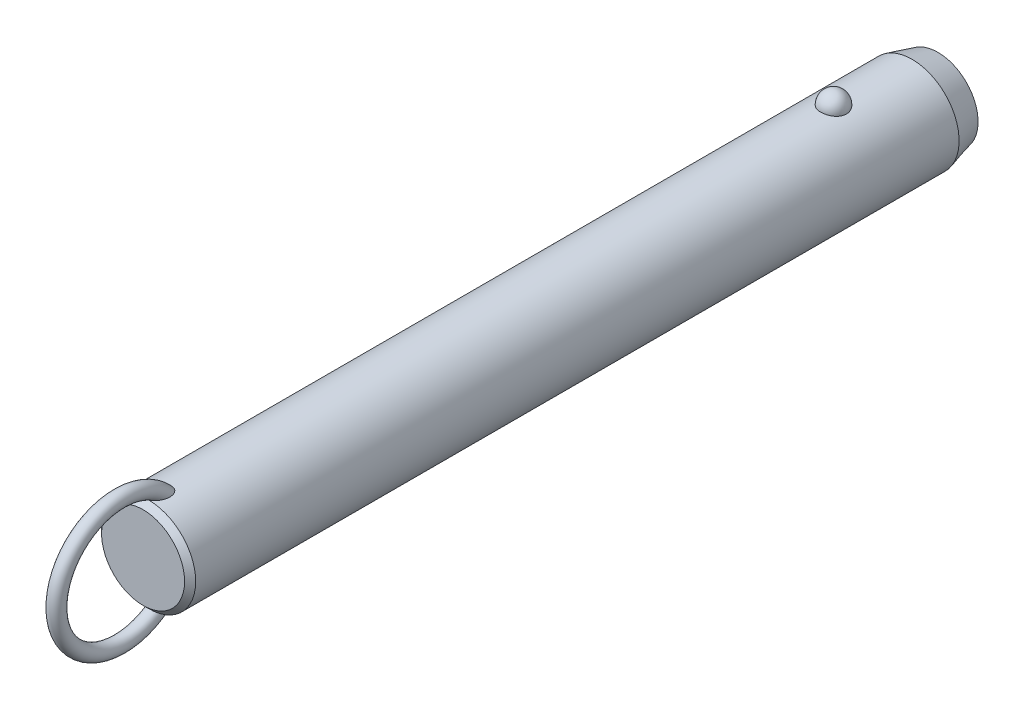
ISO-10303-21;
HEADER;
FILE_DESCRIPTION(('STEP AP214'),'2;1');
FILE_NAME('part.step','',(''),(''),'','','');
FILE_SCHEMA(('AUTOMOTIVE_DESIGN { 1 0 10303 214 1 1 1 1 }'));
ENDSEC;
DATA;
#1=APPLICATION_CONTEXT('core data for automotive mechanical design processes');
#2=APPLICATION_PROTOCOL_DEFINITION('international standard','automotive_design',2000,#1);
#3=PRODUCT_CONTEXT('',#1,'mechanical');
#4=PRODUCT('Part','Part','',(#3));
#5=PRODUCT_RELATED_PRODUCT_CATEGORY('part','',(#4));
#6=PRODUCT_DEFINITION_FORMATION('','',#4);
#7=PRODUCT_DEFINITION_CONTEXT('part definition',#1,'design');
#8=PRODUCT_DEFINITION('design','',#6,#7);
#9=PRODUCT_DEFINITION_SHAPE('','',#8);
#10=(LENGTH_UNIT() NAMED_UNIT(*) SI_UNIT(.MILLI.,.METRE.));
#11=(NAMED_UNIT(*) PLANE_ANGLE_UNIT() SI_UNIT($,.RADIAN.));
#12=(NAMED_UNIT(*) SI_UNIT($,.STERADIAN.) SOLID_ANGLE_UNIT());
#13=UNCERTAINTY_MEASURE_WITH_UNIT(LENGTH_MEASURE(1.E-05),#10,'distance_accuracy_value','');
#14=(GEOMETRIC_REPRESENTATION_CONTEXT(3) GLOBAL_UNCERTAINTY_ASSIGNED_CONTEXT((#13)) GLOBAL_UNIT_ASSIGNED_CONTEXT((#10,
#11,#12)) REPRESENTATION_CONTEXT('',''));
#15=CARTESIAN_POINT('',(0.,0.,0.));
#16=DIRECTION('',(0.,0.,1.));
#17=DIRECTION('',(1.,0.,0.));
#18=AXIS2_PLACEMENT_3D('',#15,#16,#17);
#19=CARTESIAN_POINT('',(0.,0.,170.2));
#20=DIRECTION('',(0.,0.,-1.));
#21=DIRECTION('',(-1.,0.,0.));
#22=AXIS2_PLACEMENT_3D('',#19,#20,#21);
#23=CYLINDRICAL_SURFACE('',#22,12.7);
#24=CARTESIAN_POINT('',(3.46661256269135,12.2177165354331,-3.5));
#25=CARTESIAN_POINT('',(3.4666090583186,12.2177194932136,-3.30432790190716));
#26=CARTESIAN_POINT('',(3.45063567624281,12.2222841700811,-3.10861112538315));
#27=CARTESIAN_POINT('',(3.38712451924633,12.2400345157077,-2.72271899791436));
#28=CARTESIAN_POINT('',(3.33957415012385,12.2532236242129,-2.53254588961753));
#29=CARTESIAN_POINT('',(3.2141234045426,12.286724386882,-2.16324948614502));
#30=CARTESIAN_POINT('',(3.13623639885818,12.3070329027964,-1.98412136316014));
#31=CARTESIAN_POINT('',(2.95205930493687,12.3525018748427,-1.64180592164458));
#32=CARTESIAN_POINT('',(2.84577003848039,12.3776621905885,-1.47861814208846));
#33=CARTESIAN_POINT('',(2.60688050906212,12.4301712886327,-1.17190583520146));
#34=CARTESIAN_POINT('',(2.47415697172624,12.4575299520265,-1.02847897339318));
#35=CARTESIAN_POINT('',(2.18615174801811,12.5112810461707,-0.766177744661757));
#36=CARTESIAN_POINT('',(2.03087002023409,12.5376734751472,-0.647303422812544));
#37=CARTESIAN_POINT('',(1.70237334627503,12.5864761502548,-0.437732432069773));
#38=CARTESIAN_POINT('',(1.52920948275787,12.6088972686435,-0.34695830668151));
#39=CARTESIAN_POINT('',(1.16944170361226,12.6473352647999,-0.195750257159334));
#40=CARTESIAN_POINT('',(0.982839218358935,12.663352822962,-0.135313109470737));
#41=CARTESIAN_POINT('',(0.604961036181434,12.6869706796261,-0.0473241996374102));
#42=CARTESIAN_POINT('',(0.413823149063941,12.6947125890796,-0.0192185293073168));
#43=CARTESIAN_POINT('',(0.0293827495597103,12.7014203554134,0.00517254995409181));
#44=CARTESIAN_POINT('',(-0.163919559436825,12.7003870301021,0.00146092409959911));
#45=CARTESIAN_POINT('',(-0.544374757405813,12.689735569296,-0.0373939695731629));
#46=CARTESIAN_POINT('',(-0.731575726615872,12.6802364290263,-0.0721015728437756));
#47=CARTESIAN_POINT('',(-1.09733277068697,12.6538333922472,-0.171364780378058));
#48=CARTESIAN_POINT('',(-1.27588869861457,12.6369293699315,-0.23592089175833));
#49=CARTESIAN_POINT('',(-1.6204698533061,12.5973946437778,-0.393548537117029));
#50=CARTESIAN_POINT('',(-1.78641865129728,12.5747321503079,-0.48677898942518));
#51=CARTESIAN_POINT('',(-2.10030671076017,12.5261316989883,-0.699110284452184));
#52=CARTESIAN_POINT('',(-2.24824419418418,12.5001934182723,-0.818213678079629));
#53=CARTESIAN_POINT('',(-2.52491489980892,12.4472906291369,-1.08157124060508));
#54=CARTESIAN_POINT('',(-2.65324222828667,12.4203160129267,-1.22624992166));
#55=CARTESIAN_POINT('',(-2.88410007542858,12.3687509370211,-1.53528325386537));
#56=CARTESIAN_POINT('',(-2.98662883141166,12.3441606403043,-1.69963924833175));
#57=CARTESIAN_POINT('',(-3.16432417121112,12.2998199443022,-2.04548497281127));
#58=CARTESIAN_POINT('',(-3.23917525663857,12.2801261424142,-2.22714424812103));
#59=CARTESIAN_POINT('',(-3.35800573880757,12.248167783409,-2.6009138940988));
#60=CARTESIAN_POINT('',(-3.4019860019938,12.2359030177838,-2.79302397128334));
#61=CARTESIAN_POINT('',(-3.45784812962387,12.2202347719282,-3.18140279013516));
#62=CARTESIAN_POINT('',(-3.46986123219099,12.2167950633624,-3.37765118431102));
#63=CARTESIAN_POINT('',(-3.46186273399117,12.2190638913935,-3.76943689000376));
#64=CARTESIAN_POINT('',(-3.44185196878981,12.2247721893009,-3.96497421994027));
#65=CARTESIAN_POINT('',(-3.37048652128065,12.2446381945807,-4.34881728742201));
#66=CARTESIAN_POINT('',(-3.31928253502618,12.2587552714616,-4.53715319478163));
#67=CARTESIAN_POINT('',(-3.18693461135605,12.2938237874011,-4.90231727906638));
#68=CARTESIAN_POINT('',(-3.1057895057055,12.3147754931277,-5.07914500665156));
#69=CARTESIAN_POINT('',(-2.91506431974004,12.3613125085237,-5.4173205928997));
#70=CARTESIAN_POINT('',(-2.80533587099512,12.3869217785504,-5.57858147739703));
#71=CARTESIAN_POINT('',(-2.560414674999,12.4398525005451,-5.88013283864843));
#72=CARTESIAN_POINT('',(-2.42522099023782,12.4671740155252,-6.02042254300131));
#73=CARTESIAN_POINT('',(-2.1323357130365,12.5205965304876,-6.27662798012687));
#74=CARTESIAN_POINT('',(-1.97456596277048,12.5466928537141,-6.39245542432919));
#75=CARTESIAN_POINT('',(-1.64115839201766,12.5946384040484,-6.59583547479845));
#76=CARTESIAN_POINT('',(-1.46552179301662,12.6164879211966,-6.68339001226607));
#77=CARTESIAN_POINT('',(-1.10356050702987,12.6532533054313,-6.82682153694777));
#78=CARTESIAN_POINT('',(-0.917391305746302,12.6682500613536,-6.88306988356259));
#79=CARTESIAN_POINT('',(-0.537836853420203,12.6900288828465,-6.96386887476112));
#80=CARTESIAN_POINT('',(-0.344452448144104,12.6968119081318,-6.9884232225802));
#81=CARTESIAN_POINT('',(0.0402577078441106,12.7013667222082,-7.00496469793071));
#82=CARTESIAN_POINT('',(0.231556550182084,12.6993008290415,-6.99753844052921));
#83=CARTESIAN_POINT('',(0.610105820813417,12.6867505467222,-6.95166366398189));
#84=CARTESIAN_POINT('',(0.797356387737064,12.6762664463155,-6.91321620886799));
#85=CARTESIAN_POINT('',(1.16186657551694,12.6480587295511,-6.80658431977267));
#86=CARTESIAN_POINT('',(1.33915951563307,12.6303611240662,-6.73850666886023));
#87=CARTESIAN_POINT('',(1.67968518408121,12.5896027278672,-6.57450875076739));
#88=CARTESIAN_POINT('',(1.84291705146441,12.5665416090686,-6.47858678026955));
#89=CARTESIAN_POINT('',(2.15340192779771,12.5171072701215,-6.25982455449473));
#90=CARTESIAN_POINT('',(2.30037831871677,12.4906895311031,-6.13660186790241));
#91=CARTESIAN_POINT('',(2.5717412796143,12.4376567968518,-5.86739587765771));
#92=CARTESIAN_POINT('',(2.69612388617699,12.4110417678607,-5.72140858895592));
#93=CARTESIAN_POINT('',(2.92107785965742,12.360051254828,-5.40794137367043));
#94=CARTESIAN_POINT('',(3.02121329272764,12.3357209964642,-5.24014110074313));
#95=CARTESIAN_POINT('',(3.19236291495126,12.2925446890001,-4.8896986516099));
#96=CARTESIAN_POINT('',(3.26338839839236,12.2736965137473,-4.70706226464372));
#97=CARTESIAN_POINT('',(3.36788038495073,12.245404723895,-4.35469510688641));
#98=CARTESIAN_POINT('',(3.40484026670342,12.2351018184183,-4.18605935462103));
#99=CARTESIAN_POINT('',(3.45420764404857,12.2212564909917,-3.84496058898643));
#100=CARTESIAN_POINT('',(3.46661565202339,12.2177139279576,-3.67249765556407));
#101=CARTESIAN_POINT('',(3.46661256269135,12.2177165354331,-3.5));
#102=B_SPLINE_CURVE_WITH_KNOTS('',3,(#24,#25,#26,#27,#28,#29,#30,#31,#32,#33,#34,#35,#36,#37,
#38,#39,#40,#41,#42,#43,#44,#45,#46,#47,#48,#49,#50,#51,#52,#53,#54,#55,#56,#57,#58,#59,#60,#61,
#62,#63,#64,#65,#66,#67,#68,#69,#70,#71,#72,#73,#74,#75,#76,#77,#78,#79,#80,#81,#82,#83,#84,#85,
#86,#87,#88,#89,#90,#91,#92,#93,#94,#95,#96,#97,#98,#99,#100,#101),.UNSPECIFIED.,.T.,.F.,(4,2,2,
2,2,2,2,2,2,2,2,2,2,2,2,2,2,2,2,2,2,2,2,2,2,2,2,2,2,2,2,2,2,2,2,2,2,2,4),(0.,0.586396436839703,
1.17302689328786,1.7593990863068,2.34575431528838,2.93491084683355,3.52406845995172,
4.1115873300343,4.69904375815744,5.2762784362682,5.85345931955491,6.42265312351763,
6.99185659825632,7.56427334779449,8.136746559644,8.71981013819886,9.3029135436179,
9.89247258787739,10.4820150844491,11.0691335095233,11.6562366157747,12.2405256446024,
12.8248374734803,13.412244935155,13.9996740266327,14.5891883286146,15.1786623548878,
15.7609861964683,16.3432419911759,16.914863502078,17.4864654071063,18.056024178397,
18.6256177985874,19.2037609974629,19.7820055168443,20.3699810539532,20.9577282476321,
21.4746855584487,21.9916320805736),.UNSPECIFIED.);
#103=CARTESIAN_POINT('',(3.46661256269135,12.2177165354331,-3.5));
#104=VERTEX_POINT('',#103);
#105=EDGE_CURVE('E41',#104,#104,#102,.T.);
#106=ORIENTED_EDGE('',*,*,#105,.T.);
#107=EDGE_LOOP('',(#106));
#108=FACE_BOUND('',#107,.T.);
#109=CARTESIAN_POINT('',(0.,0.,181.4));
#110=DIRECTION('',(0.,0.,1.));
#111=DIRECTION('',(1.,0.,0.));
#112=AXIS2_PLACEMENT_3D('',#109,#110,#111);
#113=CIRCLE('',#112,12.7);
#114=CARTESIAN_POINT('',(12.7,0.,181.4));
#115=VERTEX_POINT('',#114);
#116=EDGE_CURVE('E10',#115,#115,#113,.F.);
#117=ORIENTED_EDGE('',*,*,#116,.T.);
#118=EDGE_LOOP('',(#117));
#119=FACE_BOUND('',#118,.T.);
#120=CARTESIAN_POINT('',(-0.548122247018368,-12.6881662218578,175.143218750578));
#121=CARTESIAN_POINT('',(-0.648865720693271,-12.6838128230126,175.177926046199));
#122=CARTESIAN_POINT('',(-0.746398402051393,-12.6783867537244,175.222042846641));
#123=CARTESIAN_POINT('',(-0.932125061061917,-12.666091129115,175.326764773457));
#124=CARTESIAN_POINT('',(-1.02030388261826,-12.6592192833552,175.387396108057));
#125=CARTESIAN_POINT('',(-1.18487740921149,-12.6448747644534,175.521847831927));
#126=CARTESIAN_POINT('',(-1.26134296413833,-12.637406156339,175.595582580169));
#127=CARTESIAN_POINT('',(-1.40231200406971,-12.6225412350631,175.753604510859));
#128=CARTESIAN_POINT('',(-1.46681470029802,-12.6151449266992,175.83789238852));
#129=CARTESIAN_POINT('',(-1.60714786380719,-12.5981718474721,176.049657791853));
#130=CARTESIAN_POINT('',(-1.677251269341,-12.588900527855,176.180962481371));
#131=CARTESIAN_POINT('',(-1.79536591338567,-12.5725964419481,176.453247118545));
#132=CARTESIAN_POINT('',(-1.84333535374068,-12.5655679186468,176.594244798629));
#133=CARTESIAN_POINT('',(-1.93422576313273,-12.5519624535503,176.937645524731));
#134=CARTESIAN_POINT('',(-1.96788773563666,-12.5466298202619,177.142557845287));
#135=CARTESIAN_POINT('',(-1.99413993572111,-12.542463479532,177.451760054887));
#136=CARTESIAN_POINT('',(-1.99883864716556,-12.5417153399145,177.555298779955));
#137=CARTESIAN_POINT('',(-2.00078003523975,-12.5414074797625,177.76245124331));
#138=CARTESIAN_POINT('',(-1.99802449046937,-12.5418474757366,177.866064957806));
#139=CARTESIAN_POINT('',(-1.98336733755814,-12.5441750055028,178.110320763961));
#140=CARTESIAN_POINT('',(-1.96851430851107,-12.5465291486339,178.250780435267));
#141=CARTESIAN_POINT('',(-1.92707089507,-12.5529612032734,178.529960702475));
#142=CARTESIAN_POINT('',(-1.90047458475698,-12.5570399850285,178.668680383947));
#143=CARTESIAN_POINT('',(-1.8361912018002,-12.5666008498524,178.94341135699));
#144=CARTESIAN_POINT('',(-1.79850828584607,-12.57208240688,179.079423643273));
#145=CARTESIAN_POINT('',(-1.71223796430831,-12.5841228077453,179.347842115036));
#146=CARTESIAN_POINT('',(-1.66365679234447,-12.5906810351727,179.480250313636));
#147=CARTESIAN_POINT('',(-1.57804503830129,-12.6016176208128,179.68548877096));
#148=CARTESIAN_POINT('',(-1.54477252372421,-12.6057501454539,179.759914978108));
#149=CARTESIAN_POINT('',(-1.47424480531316,-12.6141930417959,179.906839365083));
#150=CARTESIAN_POINT('',(-1.43699041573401,-12.6185033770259,179.979337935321));
#151=CARTESIAN_POINT('',(-1.35825795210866,-12.6272207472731,180.121892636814));
#152=CARTESIAN_POINT('',(-1.31678520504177,-12.6316276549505,180.191951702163));
#153=CARTESIAN_POINT('',(-1.22917793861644,-12.6404532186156,180.329070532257));
#154=CARTESIAN_POINT('',(-1.18304514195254,-12.6448718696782,180.396131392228));
#155=CARTESIAN_POINT('',(-1.07246411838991,-12.6547893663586,180.543874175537));
#156=CARTESIAN_POINT('',(-1.00642239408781,-12.6602600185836,180.623384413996));
#157=CARTESIAN_POINT('',(-0.864441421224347,-12.6707460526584,180.773169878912));
#158=CARTESIAN_POINT('',(-0.788516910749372,-12.6757620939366,180.843458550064));
#159=CARTESIAN_POINT('',(-0.652215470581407,-12.6833591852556,180.948680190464));
#160=CARTESIAN_POINT('',(-0.594982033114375,-12.6861973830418,180.987624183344));
#161=CARTESIAN_POINT('',(-0.47526962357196,-12.6912445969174,181.056489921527));
#162=CARTESIAN_POINT('',(-0.412800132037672,-12.6934547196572,181.086427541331));
#163=CARTESIAN_POINT('',(-0.29574972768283,-12.6966636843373,181.12975652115));
#164=CARTESIAN_POINT('',(-0.241949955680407,-12.6978134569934,181.145218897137));
#165=CARTESIAN_POINT('',(-0.132508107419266,-12.6994261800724,181.166884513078));
#166=CARTESIAN_POINT('',(-0.0768679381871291,-12.6998898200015,181.173097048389));
#167=CARTESIAN_POINT('',(0.0347696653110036,-12.7000752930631,181.175583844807));
#168=CARTESIAN_POINT('',(0.0907676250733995,-12.6997954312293,181.171835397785));
#169=CARTESIAN_POINT('',(0.201283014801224,-12.6985255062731,181.154788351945));
#170=CARTESIAN_POINT('',(0.25579908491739,-12.6975348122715,181.141481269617));
#171=CARTESIAN_POINT('',(0.37604233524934,-12.6946091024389,181.10203792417));
#172=CARTESIAN_POINT('',(0.440950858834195,-12.6924943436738,181.073449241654));
#173=CARTESIAN_POINT('',(0.565350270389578,-12.6875639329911,181.006323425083));
#174=CARTESIAN_POINT('',(0.624828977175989,-12.6847467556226,180.967764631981));
#175=CARTESIAN_POINT('',(0.774116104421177,-12.6767252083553,180.856949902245));
#176=CARTESIAN_POINT('',(0.859449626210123,-12.6711344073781,180.778760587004));
#177=CARTESIAN_POINT('',(1.01789440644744,-12.6593922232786,180.610943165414));
#178=CARTESIAN_POINT('',(1.09096902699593,-12.653239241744,180.521282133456));
#179=CARTESIAN_POINT('',(1.22268793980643,-12.6411674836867,180.340265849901));
#180=CARTESIAN_POINT('',(1.28193986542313,-12.6352572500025,180.249345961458));
#181=CARTESIAN_POINT('',(1.39259777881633,-12.6235401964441,180.062792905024));
#182=CARTESIAN_POINT('',(1.44399707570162,-12.6177334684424,179.967155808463));
#183=CARTESIAN_POINT('',(1.53972870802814,-12.6064093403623,179.772273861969));
#184=CARTESIAN_POINT('',(1.58405262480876,-12.6008922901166,179.673024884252));
#185=CARTESIAN_POINT('',(1.66600705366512,-12.5903187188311,179.471772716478));
#186=CARTESIAN_POINT('',(1.7036365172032,-12.5852622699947,179.369769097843));
#187=CARTESIAN_POINT('',(1.77545379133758,-12.5753406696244,179.154358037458));
#188=CARTESIAN_POINT('',(1.80903453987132,-12.5705328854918,179.040745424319));
#189=CARTESIAN_POINT('',(1.86844163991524,-12.5618400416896,178.811457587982));
#190=CARTESIAN_POINT('',(1.89426665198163,-12.5579551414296,178.695782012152));
#191=CARTESIAN_POINT('',(1.9378546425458,-12.5513030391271,178.463007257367));
#192=CARTESIAN_POINT('',(1.9556264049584,-12.5485346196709,178.345909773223));
#193=CARTESIAN_POINT('',(1.98264463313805,-12.5442934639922,178.110747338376));
#194=CARTESIAN_POINT('',(1.99189298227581,-12.5428204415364,177.99268260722));
#195=CARTESIAN_POINT('',(2.00416068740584,-12.540871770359,177.680622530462));
#196=CARTESIAN_POINT('',(1.99944433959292,-12.541631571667,177.486229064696));
#197=CARTESIAN_POINT('',(1.96113755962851,-12.5476846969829,177.100309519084));
#198=CARTESIAN_POINT('',(1.92758341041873,-12.5529723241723,176.908780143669));
#199=CARTESIAN_POINT('',(1.83934342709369,-12.5661532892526,176.582272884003));
#200=CARTESIAN_POINT('',(1.79215440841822,-12.5730485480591,176.44524997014));
#201=CARTESIAN_POINT('',(1.67676242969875,-12.588958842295,176.180445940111));
#202=CARTESIAN_POINT('',(1.60859050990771,-12.597970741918,176.052651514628));
#203=CARTESIAN_POINT('',(1.46583832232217,-12.6152829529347,175.835800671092));
#204=CARTESIAN_POINT('',(1.39525727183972,-12.6233659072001,175.74410500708));
#205=CARTESIAN_POINT('',(1.23992594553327,-12.6395676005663,175.573485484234));
#206=CARTESIAN_POINT('',(1.15517932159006,-12.6476863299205,175.494558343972));
#207=CARTESIAN_POINT('',(0.971995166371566,-12.6630846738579,175.352643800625));
#208=CARTESIAN_POINT('',(0.873456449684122,-12.6703572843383,175.289784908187));
#209=CARTESIAN_POINT('',(0.665847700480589,-12.6829569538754,175.184487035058));
#210=CARTESIAN_POINT('',(0.556784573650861,-12.688285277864,175.142034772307));
#211=CARTESIAN_POINT('',(0.347338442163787,-12.6956226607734,175.084443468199));
#212=CARTESIAN_POINT('',(0.247759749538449,-12.6979816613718,175.066399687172));
#213=CARTESIAN_POINT('',(0.0470218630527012,-12.7003077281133,175.048600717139));
#214=CARTESIAN_POINT('',(-0.0541350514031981,-12.7002779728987,175.048821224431));
#215=CARTESIAN_POINT('',(-0.221414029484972,-12.6982482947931,175.064363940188));
#216=CARTESIAN_POINT('',(-0.288055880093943,-12.6969033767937,175.074666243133));
#217=CARTESIAN_POINT('',(-0.419599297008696,-12.6932369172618,175.10313489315));
#218=CARTESIAN_POINT('',(-0.484501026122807,-12.6909154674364,175.121300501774));
#219=CARTESIAN_POINT('',(-0.548122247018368,-12.6881662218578,175.143218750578));
#220=B_SPLINE_CURVE_WITH_KNOTS('',3,(#120,#121,#122,#123,#124,#125,#126,#127,#128,#129,#130,
#131,#132,#133,#134,#135,#136,#137,#138,#139,#140,#141,#142,#143,#144,#145,#146,#147,#148,#149,
#150,#151,#152,#153,#154,#155,#156,#157,#158,#159,#160,#161,#162,#163,#164,#165,#166,#167,#168,
#169,#170,#171,#172,#173,#174,#175,#176,#177,#178,#179,#180,#181,#182,#183,#184,#185,#186,#187,
#188,#189,#190,#191,#192,#193,#194,#195,#196,#197,#198,#199,#200,#201,#202,#203,#204,#205,#206,
#207,#208,#209,#210,#211,#212,#213,#214,#215,#216,#217,#218,#219),.UNSPECIFIED.,.T.,.F.,(4,2,2,
2,2,2,2,2,2,2,2,2,2,2,2,2,2,2,2,2,2,2,2,2,2,2,2,2,2,2,2,2,2,2,2,2,2,2,2,2,2,2,2,2,2,2,2,2,2,4),
(0.,0.319642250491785,0.639794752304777,0.957927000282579,1.27608021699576,1.72100165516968,
2.16675988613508,2.78630021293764,3.09705782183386,3.4077412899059,3.83096358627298,
4.25439969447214,4.6776772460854,5.10071330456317,5.3455029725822,5.59024267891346,
5.83467707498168,6.07902143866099,6.38891080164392,6.69834321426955,6.90560910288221,
7.11250749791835,7.27977315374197,7.44687060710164,7.61434932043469,7.78197685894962,
7.99365544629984,8.20579780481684,8.55147335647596,8.89816429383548,9.22375138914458,
9.54961437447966,9.87586224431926,10.2021611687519,10.557587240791,10.9130746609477,
11.2681734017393,11.6231936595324,12.2046601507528,12.7853961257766,13.219164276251,
13.6522938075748,13.9989174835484,14.3454519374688,14.6946768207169,15.0436740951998,
15.3457513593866,15.6474266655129,15.8493051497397,16.0511646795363),.UNSPECIFIED.);
#221=CARTESIAN_POINT('',(-0.548122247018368,-12.6881662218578,175.143218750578));
#222=VERTEX_POINT('',#221);
#223=EDGE_CURVE('E60',#222,#222,#220,.T.);
#224=ORIENTED_EDGE('',*,*,#223,.T.);
#225=EDGE_LOOP('',(#224));
#226=FACE_BOUND('',#225,.T.);
#227=CARTESIAN_POINT('',(-0.548122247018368,12.6881662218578,175.143218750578));
#228=CARTESIAN_POINT('',(-0.459436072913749,12.6919968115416,175.112673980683));
#229=CARTESIAN_POINT('',(-0.368189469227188,12.6949996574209,175.089391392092));
#230=CARTESIAN_POINT('',(-0.183024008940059,12.6990186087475,175.058406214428));
#231=CARTESIAN_POINT('',(-0.08910491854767,12.7000345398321,175.050704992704));
#232=CARTESIAN_POINT('',(0.098714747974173,12.6999636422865,175.051245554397));
#233=CARTESIAN_POINT('',(0.192615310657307,12.6988761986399,175.059492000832));
#234=CARTESIAN_POINT('',(0.377658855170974,12.6947211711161,175.091551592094));
#235=CARTESIAN_POINT('',(0.468801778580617,12.6916535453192,175.115365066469));
#236=CARTESIAN_POINT('',(0.645809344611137,12.6838788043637,175.17745651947));
#237=CARTESIAN_POINT('',(0.731679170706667,12.6791733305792,175.215720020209));
#238=CARTESIAN_POINT('',(0.896315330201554,12.6686004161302,175.305120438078));
#239=CARTESIAN_POINT('',(0.975080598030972,12.6627328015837,175.356259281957));
#240=CARTESIAN_POINT('',(1.12963655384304,12.6499161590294,175.47367820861));
#241=CARTESIAN_POINT('',(1.20478673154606,12.6429194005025,175.540792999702));
#242=CARTESIAN_POINT('',(1.34448241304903,12.6288282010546,175.68522507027));
#243=CARTESIAN_POINT('',(1.40902173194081,12.621733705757,175.762548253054));
#244=CARTESIAN_POINT('',(1.55208211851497,12.6050877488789,175.959247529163));
#245=CARTESIAN_POINT('',(1.62510490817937,12.5957546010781,176.082654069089));
#246=CARTESIAN_POINT('',(1.7501904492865,12.5789823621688,176.339769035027));
#247=CARTESIAN_POINT('',(1.80221377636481,12.5715468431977,176.473496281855));
#248=CARTESIAN_POINT('',(1.90309965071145,12.5567434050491,176.798351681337));
#249=CARTESIAN_POINT('',(1.94342317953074,12.5504515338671,176.992161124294));
#250=CARTESIAN_POINT('',(1.99332997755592,12.5426147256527,177.38378810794));
#251=CARTESIAN_POINT('',(2.00285305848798,12.5410790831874,177.581612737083));
#252=CARTESIAN_POINT('',(1.99678999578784,12.5420407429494,177.916642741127));
#253=CARTESIAN_POINT('',(1.98794117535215,12.5434564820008,178.054042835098));
#254=CARTESIAN_POINT('',(1.95865119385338,12.5480641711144,178.327639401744));
#255=CARTESIAN_POINT('',(1.93820436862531,12.5512569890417,178.463835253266));
#256=CARTESIAN_POINT('',(1.886478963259,12.5591352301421,178.734249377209));
#257=CARTESIAN_POINT('',(1.85518800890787,12.5638223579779,178.868465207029));
#258=CARTESIAN_POINT('',(1.782178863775,12.5743868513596,179.133936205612));
#259=CARTESIAN_POINT('',(1.74046509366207,12.5802637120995,179.265192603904));
#260=CARTESIAN_POINT('',(1.66024095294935,12.5910571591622,179.486085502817));
#261=CARTESIAN_POINT('',(1.62434772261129,12.5957535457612,179.576690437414));
#262=CARTESIAN_POINT('',(1.54709009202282,12.6054762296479,179.755512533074));
#263=CARTESIAN_POINT('',(1.50572681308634,12.6105024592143,179.843730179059));
#264=CARTESIAN_POINT('',(1.41728020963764,12.620748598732,180.016932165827));
#265=CARTESIAN_POINT('',(1.37021377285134,12.625967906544,180.101925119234));
#266=CARTESIAN_POINT('',(1.26969620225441,12.6364721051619,180.268007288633));
#267=CARTESIAN_POINT('',(1.21624929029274,12.6417569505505,180.349099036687));
#268=CARTESIAN_POINT('',(1.10304413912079,12.6521331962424,180.504702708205));
#269=CARTESIAN_POINT('',(1.04340936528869,12.657226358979,180.579303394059));
#270=CARTESIAN_POINT('',(0.915919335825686,12.6670906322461,180.721324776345));
#271=CARTESIAN_POINT('',(0.848064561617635,12.6718617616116,180.78874589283));
#272=CARTESIAN_POINT('',(0.717035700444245,12.67987711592,180.900624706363));
#273=CARTESIAN_POINT('',(0.655526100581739,12.6832377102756,180.946997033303));
#274=CARTESIAN_POINT('',(0.525985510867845,12.6892676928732,181.029619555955));
#275=CARTESIAN_POINT('',(0.457969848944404,12.6919386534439,181.065892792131));
#276=CARTESIAN_POINT('',(0.334859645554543,12.695691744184,181.116657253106));
#277=CARTESIAN_POINT('',(0.281116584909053,12.6970073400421,181.134373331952));
#278=CARTESIAN_POINT('',(0.171425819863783,12.6989609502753,181.160642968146));
#279=CARTESIAN_POINT('',(0.115480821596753,12.699599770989,181.169207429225));
#280=CARTESIAN_POINT('',(0.00272618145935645,12.7001251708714,181.176253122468));
#281=CARTESIAN_POINT('',(-0.0540859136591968,12.7000089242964,181.174696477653));
#282=CARTESIAN_POINT('',(-0.166544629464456,12.6990328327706,181.161600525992));
#283=CARTESIAN_POINT('',(-0.222190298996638,12.6981724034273,181.150053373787));
#284=CARTESIAN_POINT('',(-0.342018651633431,12.695562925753,181.114912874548));
#285=CARTESIAN_POINT('',(-0.405606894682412,12.6936676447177,181.08933225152));
#286=CARTESIAN_POINT('',(-0.52781549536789,12.6891754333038,181.028311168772));
#287=CARTESIAN_POINT('',(-0.586425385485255,12.6865770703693,180.992850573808));
#288=CARTESIAN_POINT('',(-0.731842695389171,12.6792129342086,180.891496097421));
#289=CARTESIAN_POINT('',(-0.814709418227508,12.6740767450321,180.8200395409));
#290=CARTESIAN_POINT('',(-0.969101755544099,12.6632083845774,180.66589007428));
#291=CARTESIAN_POINT('',(-1.04059564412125,12.6574746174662,180.583166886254));
#292=CARTESIAN_POINT('',(-1.16981116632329,12.6461638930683,180.415809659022));
#293=CARTESIAN_POINT('',(-1.22811369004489,12.6405994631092,180.331616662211));
#294=CARTESIAN_POINT('',(-1.33743405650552,12.6295007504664,180.158579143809));
#295=CARTESIAN_POINT('',(-1.38844577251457,12.6239664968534,180.069730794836));
#296=CARTESIAN_POINT('',(-1.48400702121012,12.6130898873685,179.888389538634));
#297=CARTESIAN_POINT('',(-1.52854232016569,12.6077479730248,179.795889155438));
#298=CARTESIAN_POINT('',(-1.61150113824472,12.5974127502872,179.608160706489));
#299=CARTESIAN_POINT('',(-1.64992317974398,12.5924195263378,179.512931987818));
#300=CARTESIAN_POINT('',(-1.73468589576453,12.581070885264,179.28289362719));
#301=CARTESIAN_POINT('',(-1.77831261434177,12.5749388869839,179.147066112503));
#302=CARTESIAN_POINT('',(-1.85439734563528,12.5639437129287,178.872212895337));
#303=CARTESIAN_POINT('',(-1.88684994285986,12.5590811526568,178.733185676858));
#304=CARTESIAN_POINT('',(-1.9400848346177,12.550968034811,178.45309235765));
#305=CARTESIAN_POINT('',(-1.96088706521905,12.5477147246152,178.312030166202));
#306=CARTESIAN_POINT('',(-1.99000539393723,12.5431291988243,178.028668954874));
#307=CARTESIAN_POINT('',(-1.99832911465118,12.5417958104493,177.886370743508));
#308=CARTESIAN_POINT('',(-2.00166624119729,12.5412674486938,177.557627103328));
#309=CARTESIAN_POINT('',(-1.99178843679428,12.5428579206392,177.371088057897));
#310=CARTESIAN_POINT('',(-1.9445518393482,12.5502731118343,177.00162404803));
#311=CARTESIAN_POINT('',(-1.90724032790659,12.5560905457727,176.818693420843));
#312=CARTESIAN_POINT('',(-1.81330718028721,12.5699462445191,176.504848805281));
#313=CARTESIAN_POINT('',(-1.76338820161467,12.5771273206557,176.371910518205));
#314=CARTESIAN_POINT('',(-1.64305018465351,12.593414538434,176.115681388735));
#315=CARTESIAN_POINT('',(-1.57265346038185,12.6025185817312,175.992380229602));
#316=CARTESIAN_POINT('',(-1.42634956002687,12.6198178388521,175.783564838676));
#317=CARTESIAN_POINT('',(-1.35423772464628,12.6278405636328,175.695384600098));
#318=CARTESIAN_POINT('',(-1.19645664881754,12.6437632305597,175.532107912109));
#319=CARTESIAN_POINT('',(-1.11080536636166,12.6516633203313,175.456994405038));
#320=CARTESIAN_POINT('',(-0.947219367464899,12.6648319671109,175.337811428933));
#321=CARTESIAN_POINT('',(-0.871624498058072,12.670300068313,175.290541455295));
#322=CARTESIAN_POINT('',(-0.714161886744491,12.6801492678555,175.2077413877));
#323=CARTESIAN_POINT('',(-0.632295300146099,12.684530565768,175.17220913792));
#324=CARTESIAN_POINT('',(-0.548122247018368,12.6881662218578,175.143218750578));
#325=B_SPLINE_CURVE_WITH_KNOTS('',3,(#227,#228,#229,#230,#231,#232,#233,#234,#235,#236,#237,
#238,#239,#240,#241,#242,#243,#244,#245,#246,#247,#248,#249,#250,#251,#252,#253,#254,#255,#256,
#257,#258,#259,#260,#261,#262,#263,#264,#265,#266,#267,#268,#269,#270,#271,#272,#273,#274,#275,
#276,#277,#278,#279,#280,#281,#282,#283,#284,#285,#286,#287,#288,#289,#290,#291,#292,#293,#294,
#295,#296,#297,#298,#299,#300,#301,#302,#303,#304,#305,#306,#307,#308,#309,#310,#311,#312,#313,
#314,#315,#316,#317,#318,#319,#320,#321,#322,#323,#324),.UNSPECIFIED.,.T.,.F.,(4,2,2,2,2,2,2,2,
2,2,2,2,2,2,2,2,2,2,2,2,2,2,2,2,2,2,2,2,2,2,2,2,2,2,2,2,2,2,2,2,2,2,2,2,2,2,2,2,4),(0.,
0.281328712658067,0.562682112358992,0.844117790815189,1.12555942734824,1.40671982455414,
1.68792232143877,1.98972294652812,2.29169886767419,2.72039860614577,3.14989948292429,
3.74084916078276,4.33295293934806,4.74554109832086,5.15833092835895,5.57159335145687,
5.98468079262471,6.27722775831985,6.56971484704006,6.86135609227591,7.15280542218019,
7.43927407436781,7.72572595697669,7.95635862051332,8.18646071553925,8.35559393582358,
8.52452541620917,8.69408946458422,8.86378678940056,9.06834348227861,9.27332014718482,
9.60010414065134,9.92778432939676,10.2350252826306,10.5425229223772,10.8506864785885,
11.1589244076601,11.5867893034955,12.0148612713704,12.4421984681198,12.8692745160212,
13.4279365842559,13.9856380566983,14.4107062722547,14.8353130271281,15.1765567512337,
15.5173516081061,15.7844129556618,16.051425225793),.UNSPECIFIED.);
#326=CARTESIAN_POINT('',(-0.548122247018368,12.6881662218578,175.143218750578));
#327=VERTEX_POINT('',#326);
#328=EDGE_CURVE('E67',#327,#327,#325,.T.);
#329=ORIENTED_EDGE('',*,*,#328,.T.);
#330=EDGE_LOOP('',(#329));
#331=FACE_BOUND('',#330,.T.);
#332=CARTESIAN_POINT('',(0.,0.,-24.6999999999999));
#333=DIRECTION('',(0.,0.,-1.));
#334=DIRECTION('',(-1.,0.,0.));
#335=AXIS2_PLACEMENT_3D('',#332,#333,#334);
#336=CIRCLE('',#335,12.7);
#337=CARTESIAN_POINT('',(-12.7,0.,-24.6999999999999));
#338=VERTEX_POINT('',#337);
#339=EDGE_CURVE('E57',#338,#338,#336,.F.);
#340=ORIENTED_EDGE('',*,*,#339,.T.);
#341=EDGE_LOOP('',(#340));
#342=FACE_BOUND('',#341,.T.);
#343=ADVANCED_FACE('F37',(#108,#119,#226,#331,#342),#23,.T.);
#344=CARTESIAN_POINT('',(0.,0.,-31.7));
#345=DIRECTION('',(0.,0.,-1.));
#346=DIRECTION('',(-1.,0.,0.));
#347=AXIS2_PLACEMENT_3D('',#344,#345,#346);
#348=PLANE('',#347);
#349=CARTESIAN_POINT('',(0.,0.,-31.7));
#350=DIRECTION('',(0.,0.,-1.));
#351=DIRECTION('',(-1.,0.,0.));
#352=AXIS2_PLACEMENT_3D('',#349,#350,#351);
#353=CIRCLE('',#352,10.8243556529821);
#354=CARTESIAN_POINT('',(-10.8243556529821,0.,-31.7));
#355=VERTEX_POINT('',#354);
#356=EDGE_CURVE('E66',#355,#355,#353,.T.);
#357=ORIENTED_EDGE('',*,*,#356,.T.);
#358=EDGE_LOOP('',(#357));
#359=FACE_BOUND('',#358,.T.);
#360=ADVANCED_FACE('F85',(#359),#348,.T.);
#361=CARTESIAN_POINT('',(0.,0.,-31.7));
#362=DIRECTION('',(0.,0.,1.));
#363=DIRECTION('',(1.,0.,0.));
#364=AXIS2_PLACEMENT_3D('',#361,#362,#363);
#365=CONICAL_SURFACE('',#364,10.8243556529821,0.261799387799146);
#366=ORIENTED_EDGE('',*,*,#339,.F.);
#367=EDGE_LOOP('',(#366));
#368=FACE_BOUND('',#367,.T.);
#369=ORIENTED_EDGE('',*,*,#356,.F.);
#370=EDGE_LOOP('',(#369));
#371=FACE_BOUND('',#370,.T.);
#372=ADVANCED_FACE('F83',(#368,#371),#365,.T.);
#373=CARTESIAN_POINT('',(0.,0.,182.9));
#374=DIRECTION('',(0.,0.,1.));
#375=DIRECTION('',(1.,0.,0.));
#376=AXIS2_PLACEMENT_3D('',#373,#374,#375);
#377=PLANE('',#376);
#378=CARTESIAN_POINT('',(0.,0.,182.9));
#379=DIRECTION('',(0.,0.,1.));
#380=DIRECTION('',(1.,0.,0.));
#381=AXIS2_PLACEMENT_3D('',#378,#379,#380);
#382=CIRCLE('',#381,11.2);
#383=CARTESIAN_POINT('',(11.2,0.,182.9));
#384=VERTEX_POINT('',#383);
#385=EDGE_CURVE('E50',#384,#384,#382,.T.);
#386=ORIENTED_EDGE('',*,*,#385,.T.);
#387=EDGE_LOOP('',(#386));
#388=FACE_BOUND('',#387,.T.);
#389=ADVANCED_FACE('F77',(#388),#377,.T.);
#390=CARTESIAN_POINT('',(0.,0.,189.25));
#391=DIRECTION('',(1.,0.,0.));
#392=DIRECTION('',(0.,0.,-1.));
#393=AXIS2_PLACEMENT_3D('',#390,#391,#392);
#394=TOROIDAL_SURFACE('',#393,17.05,2.);
#395=ORIENTED_EDGE('',*,*,#328,.F.);
#396=EDGE_LOOP('',(#395));
#397=FACE_BOUND('',#396,.T.);
#398=ORIENTED_EDGE('',*,*,#223,.F.);
#399=EDGE_LOOP('',(#398));
#400=FACE_BOUND('',#399,.T.);
#401=ADVANCED_FACE('F73',(#397,#400),#394,.T.);
#402=CARTESIAN_POINT('',(0.,0.,182.9));
#403=DIRECTION('',(0.,0.,-1.));
#404=DIRECTION('',(-1.,0.,0.));
#405=AXIS2_PLACEMENT_3D('',#402,#403,#404);
#406=CONICAL_SURFACE('',#405,11.2,0.785398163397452);
#407=ORIENTED_EDGE('',*,*,#116,.F.);
#408=EDGE_LOOP('',(#407));
#409=FACE_BOUND('',#408,.T.);
#410=ORIENTED_EDGE('',*,*,#385,.F.);
#411=EDGE_LOOP('',(#410));
#412=FACE_BOUND('',#411,.T.);
#413=ADVANCED_FACE('F39',(#409,#412),#406,.T.);
#414=CARTESIAN_POINT('',(0.,12.7,-3.5));
#415=DIRECTION('',(0.,1.,0.));
#416=DIRECTION('',(0.,0.,1.));
#417=AXIS2_PLACEMENT_3D('',#414,#415,#416);
#418=SPHERICAL_SURFACE('',#417,3.5);
#419=ORIENTED_EDGE('',*,*,#105,.F.);
#420=EDGE_LOOP('',(#419));
#421=FACE_BOUND('',#420,.T.);
#422=ADVANCED_FACE('F79',(#421),#418,.T.);
#423=CLOSED_SHELL('',(#343,#360,#372,#389,#401,#413,#422));
#424=MANIFOLD_SOLID_BREP('B2',#423);
#425=ADVANCED_BREP_SHAPE_REPRESENTATION('',(#18,#424),#14);
#426=SHAPE_DEFINITION_REPRESENTATION(#9,#425);
ENDSEC;
END-ISO-10303-21;
